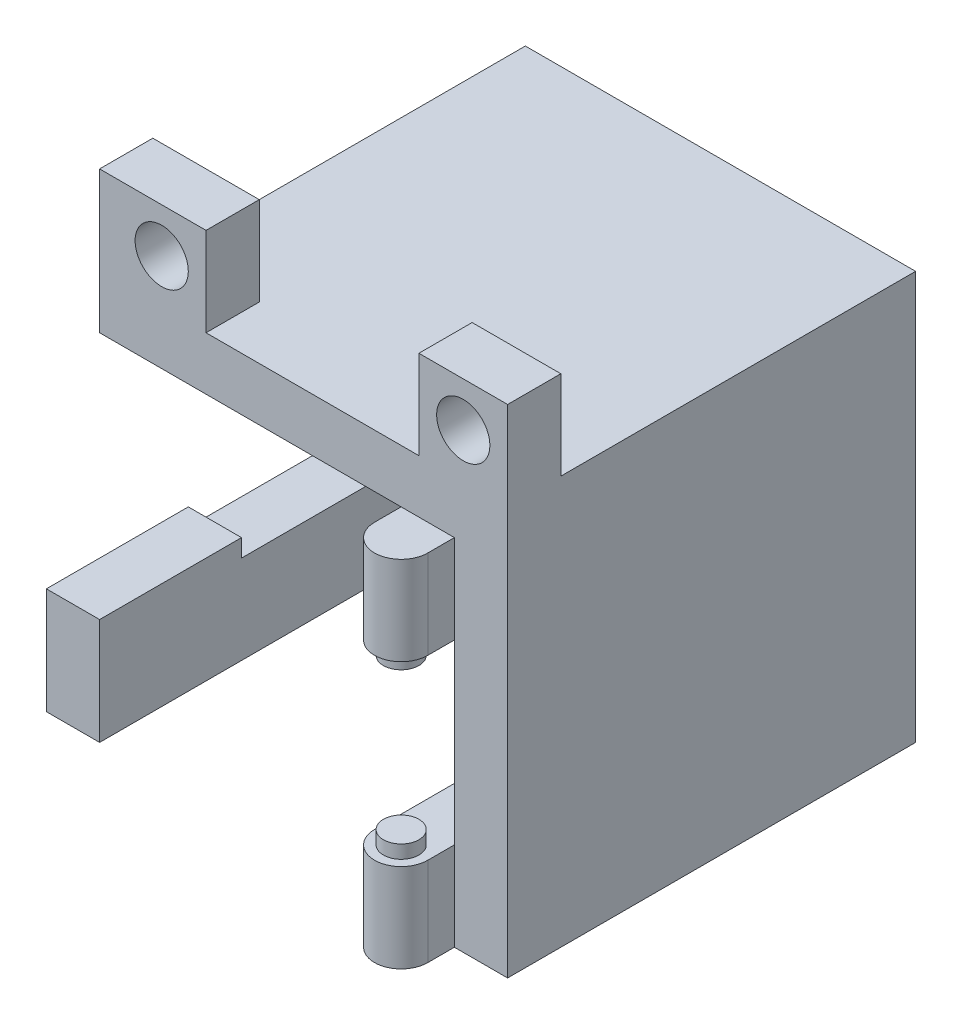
ISO-10303-21;
HEADER;
FILE_DESCRIPTION(('STEP AP214'),'2;1');
FILE_NAME('part.step','',(''),(''),'','','');
FILE_SCHEMA(('AUTOMOTIVE_DESIGN { 1 0 10303 214 1 1 1 1 }'));
ENDSEC;
DATA;
#1=APPLICATION_CONTEXT('core data for automotive mechanical design processes');
#2=APPLICATION_PROTOCOL_DEFINITION('international standard','automotive_design',2000,#1);
#3=PRODUCT_CONTEXT('',#1,'mechanical');
#4=PRODUCT('Part','Part','',(#3));
#5=PRODUCT_RELATED_PRODUCT_CATEGORY('part','',(#4));
#6=PRODUCT_DEFINITION_FORMATION('','',#4);
#7=PRODUCT_DEFINITION_CONTEXT('part definition',#1,'design');
#8=PRODUCT_DEFINITION('design','',#6,#7);
#9=PRODUCT_DEFINITION_SHAPE('','',#8);
#10=(LENGTH_UNIT() NAMED_UNIT(*) SI_UNIT(.MILLI.,.METRE.));
#11=(NAMED_UNIT(*) PLANE_ANGLE_UNIT() SI_UNIT($,.RADIAN.));
#12=(NAMED_UNIT(*) SI_UNIT($,.STERADIAN.) SOLID_ANGLE_UNIT());
#13=UNCERTAINTY_MEASURE_WITH_UNIT(LENGTH_MEASURE(1.E-05),#10,'distance_accuracy_value','');
#14=(GEOMETRIC_REPRESENTATION_CONTEXT(3) GLOBAL_UNCERTAINTY_ASSIGNED_CONTEXT((#13)) GLOBAL_UNIT_ASSIGNED_CONTEXT((#10,
#11,#12)) REPRESENTATION_CONTEXT('',''));
#15=CARTESIAN_POINT('',(0.,0.,0.));
#16=DIRECTION('',(0.,0.,1.));
#17=DIRECTION('',(1.,0.,0.));
#18=AXIS2_PLACEMENT_3D('',#15,#16,#17);
#19=CARTESIAN_POINT('',(-10.,20.,-8.5));
#20=DIRECTION('',(0.,1.,0.));
#21=DIRECTION('',(0.,0.,1.));
#22=AXIS2_PLACEMENT_3D('',#19,#20,#21);
#23=PLANE('',#22);
#24=DIRECTION('',(0.,0.,-1.));
#25=VECTOR('',#24,1.);
#26=CARTESIAN_POINT('',(7.,20.,11.5));
#27=LINE('',#26,#25);
#28=CARTESIAN_POINT('',(7.,20.,11.5));
#29=VERTEX_POINT('',#28);
#30=CARTESIAN_POINT('',(7.,20.,8.5));
#31=VERTEX_POINT('',#30);
#32=EDGE_CURVE('E65',#29,#31,#27,.T.);
#33=ORIENTED_EDGE('',*,*,#32,.F.);
#34=DIRECTION('',(-1.,0.,0.));
#35=VECTOR('',#34,1.);
#36=CARTESIAN_POINT('',(-10.,20.,11.5));
#37=LINE('',#36,#35);
#38=CARTESIAN_POINT('',(-10.,20.,11.5));
#39=VERTEX_POINT('',#38);
#40=EDGE_CURVE('E591',#29,#39,#37,.T.);
#41=ORIENTED_EDGE('',*,*,#40,.T.);
#42=DIRECTION('',(0.,0.,1.));
#43=VECTOR('',#42,1.);
#44=CARTESIAN_POINT('',(-10.,20.,11.5));
#45=LINE('',#44,#43);
#46=CARTESIAN_POINT('',(-10.,20.,3.5));
#47=VERTEX_POINT('',#46);
#48=EDGE_CURVE('E374',#47,#39,#45,.T.);
#49=ORIENTED_EDGE('',*,*,#48,.F.);
#50=DIRECTION('',(1.,0.,0.));
#51=VECTOR('',#50,1.);
#52=CARTESIAN_POINT('',(-10.,20.,3.5));
#53=LINE('',#52,#51);
#54=CARTESIAN_POINT('',(-9.,20.,3.5));
#55=VERTEX_POINT('',#54);
#56=EDGE_CURVE('E390',#47,#55,#53,.T.);
#57=ORIENTED_EDGE('',*,*,#56,.T.);
#58=DIRECTION('',(0.,0.,1.));
#59=VECTOR('',#58,1.);
#60=CARTESIAN_POINT('',(-9.,20.,-11.501));
#61=LINE('',#60,#59);
#62=CARTESIAN_POINT('',(-9.,20.,-11.5));
#63=VERTEX_POINT('',#62);
#64=EDGE_CURVE('E499',#63,#55,#61,.T.);
#65=ORIENTED_EDGE('',*,*,#64,.F.);
#66=DIRECTION('',(1.,0.,0.));
#67=VECTOR('',#66,1.);
#68=CARTESIAN_POINT('',(-9.,20.,-11.5));
#69=LINE('',#68,#67);
#70=CARTESIAN_POINT('',(-8.,20.,-11.5));
#71=VERTEX_POINT('',#70);
#72=EDGE_CURVE('E532',#63,#71,#69,.T.);
#73=ORIENTED_EDGE('',*,*,#72,.T.);
#74=DIRECTION('',(0.,0.,1.));
#75=VECTOR('',#74,1.);
#76=CARTESIAN_POINT('',(-8.,20.,-11.501));
#77=LINE('',#76,#75);
#78=CARTESIAN_POINT('',(-8.,20.,-8.5));
#79=VERTEX_POINT('',#78);
#80=EDGE_CURVE('E546',#71,#79,#77,.T.);
#81=ORIENTED_EDGE('',*,*,#80,.T.);
#82=DIRECTION('',(-1.,0.,0.));
#83=VECTOR('',#82,1.);
#84=CARTESIAN_POINT('',(-10.,20.,-8.5));
#85=LINE('',#84,#83);
#86=CARTESIAN_POINT('',(10.,20.,-8.5));
#87=VERTEX_POINT('',#86);
#88=EDGE_CURVE('E579',#87,#79,#85,.T.);
#89=ORIENTED_EDGE('',*,*,#88,.F.);
#90=DIRECTION('',(0.,0.,1.));
#91=VECTOR('',#90,1.);
#92=CARTESIAN_POINT('',(10.,20.,-8.5));
#93=LINE('',#92,#91);
#94=CARTESIAN_POINT('',(10.,20.,8.5));
#95=VERTEX_POINT('',#94);
#96=EDGE_CURVE('E596',#87,#95,#93,.T.);
#97=ORIENTED_EDGE('',*,*,#96,.T.);
#98=DIRECTION('',(1.,0.,0.));
#99=VECTOR('',#98,1.);
#100=CARTESIAN_POINT('',(10.,20.,8.5));
#101=LINE('',#100,#99);
#102=EDGE_CURVE('E61',#31,#95,#101,.T.);
#103=ORIENTED_EDGE('',*,*,#102,.F.);
#104=EDGE_LOOP('',(#33,#41,#49,#57,#65,#73,#81,#89,#97,#103));
#105=FACE_BOUND('',#104,.T.);
#106=ADVANCED_FACE('F45',(#105),#23,.F.);
#107=CARTESIAN_POINT('',(10.,20.,-8.5));
#108=DIRECTION('',(1.,0.,0.));
#109=DIRECTION('',(0.,1.,0.));
#110=AXIS2_PLACEMENT_3D('',#107,#108,#109);
#111=PLANE('',#110);
#112=DIRECTION('',(0.,1.,0.));
#113=VECTOR('',#112,1.);
#114=CARTESIAN_POINT('',(10.,15.,8.5));
#115=LINE('',#114,#113);
#116=CARTESIAN_POINT('',(10.,15.,8.5));
#117=VERTEX_POINT('',#116);
#118=EDGE_CURVE('E284',#117,#95,#115,.T.);
#119=ORIENTED_EDGE('',*,*,#118,.T.);
#120=ORIENTED_EDGE('',*,*,#96,.F.);
#121=DIRECTION('',(0.,1.,0.));
#122=VECTOR('',#121,1.);
#123=CARTESIAN_POINT('',(10.,20.,-8.5));
#124=LINE('',#123,#122);
#125=CARTESIAN_POINT('',(10.,0.,-8.5));
#126=VERTEX_POINT('',#125);
#127=EDGE_CURVE('E575',#126,#87,#124,.T.);
#128=ORIENTED_EDGE('',*,*,#127,.F.);
#129=DIRECTION('',(0.,0.,1.));
#130=VECTOR('',#129,1.);
#131=CARTESIAN_POINT('',(10.,0.,-8.5));
#132=LINE('',#131,#130);
#133=CARTESIAN_POINT('',(10.,0.,8.5));
#134=VERTEX_POINT('',#133);
#135=EDGE_CURVE('E600',#126,#134,#132,.T.);
#136=ORIENTED_EDGE('',*,*,#135,.T.);
#137=DIRECTION('',(0.,-1.,0.));
#138=VECTOR('',#137,1.);
#139=CARTESIAN_POINT('',(10.,5.,8.5));
#140=LINE('',#139,#138);
#141=CARTESIAN_POINT('',(10.,5.,8.5));
#142=VERTEX_POINT('',#141);
#143=EDGE_CURVE('E352',#142,#134,#140,.T.);
#144=ORIENTED_EDGE('',*,*,#143,.F.);
#145=DIRECTION('',(0.,0.,1.));
#146=VECTOR('',#145,1.);
#147=CARTESIAN_POINT('',(10.,5.,11.5));
#148=LINE('',#147,#146);
#149=CARTESIAN_POINT('',(10.,5.,11.5));
#150=VERTEX_POINT('',#149);
#151=EDGE_CURVE('E322',#142,#150,#148,.T.);
#152=ORIENTED_EDGE('',*,*,#151,.T.);
#153=DIRECTION('',(0.,1.,0.));
#154=VECTOR('',#153,1.);
#155=CARTESIAN_POINT('',(10.,20.,11.5));
#156=LINE('',#155,#154);
#157=CARTESIAN_POINT('',(10.,15.,11.5));
#158=VERTEX_POINT('',#157);
#159=EDGE_CURVE('E592',#150,#158,#156,.T.);
#160=ORIENTED_EDGE('',*,*,#159,.T.);
#161=DIRECTION('',(0.,0.,1.));
#162=VECTOR('',#161,1.);
#163=CARTESIAN_POINT('',(10.,15.,11.5));
#164=LINE('',#163,#162);
#165=EDGE_CURVE('E288',#117,#158,#164,.T.);
#166=ORIENTED_EDGE('',*,*,#165,.F.);
#167=EDGE_LOOP('',(#119,#120,#128,#136,#144,#152,#160,#166));
#168=FACE_BOUND('',#167,.T.);
#169=ADVANCED_FACE('F730',(#168),#111,.F.);
#170=CARTESIAN_POINT('',(-9.,23.,-11.501));
#171=DIRECTION('',(1.,0.,0.));
#172=DIRECTION('',(0.,0.,-1.));
#173=AXIS2_PLACEMENT_3D('',#170,#171,#172);
#174=PLANE('',#173);
#175=DIRECTION('',(0.,-1.,0.));
#176=VECTOR('',#175,1.);
#177=CARTESIAN_POINT('',(-9.,20.,3.5));
#178=LINE('',#177,#176);
#179=CARTESIAN_POINT('',(-9.,23.,3.5));
#180=VERTEX_POINT('',#179);
#181=EDGE_CURVE('E356',#180,#55,#178,.T.);
#182=ORIENTED_EDGE('',*,*,#181,.F.);
#183=DIRECTION('',(0.,0.,1.));
#184=VECTOR('',#183,1.);
#185=CARTESIAN_POINT('',(-9.,23.,-11.501));
#186=LINE('',#185,#184);
#187=CARTESIAN_POINT('',(-9.,23.,-11.5));
#188=VERTEX_POINT('',#187);
#189=EDGE_CURVE('E541',#188,#180,#186,.T.);
#190=ORIENTED_EDGE('',*,*,#189,.F.);
#191=DIRECTION('',(0.,-1.,0.));
#192=VECTOR('',#191,1.);
#193=CARTESIAN_POINT('',(-9.,23.,-11.5));
#194=LINE('',#193,#192);
#195=EDGE_CURVE('E536',#188,#63,#194,.T.);
#196=ORIENTED_EDGE('',*,*,#195,.T.);
#197=ORIENTED_EDGE('',*,*,#64,.T.);
#198=EDGE_LOOP('',(#182,#190,#196,#197));
#199=FACE_BOUND('',#198,.T.);
#200=ADVANCED_FACE('F683',(#199),#174,.F.);
#201=CARTESIAN_POINT('',(-13.,5.,-11.501));
#202=DIRECTION('',(0.,-1.,0.));
#203=DIRECTION('',(0.,0.,-1.));
#204=AXIS2_PLACEMENT_3D('',#201,#202,#203);
#205=PLANE('',#204);
#206=DIRECTION('',(-1.,0.,0.));
#207=VECTOR('',#206,1.);
#208=CARTESIAN_POINT('',(-13.,5.,3.5));
#209=LINE('',#208,#207);
#210=CARTESIAN_POINT('',(-10.,5.,3.5));
#211=VERTEX_POINT('',#210);
#212=CARTESIAN_POINT('',(-13.,5.,3.5));
#213=VERTEX_POINT('',#212);
#214=EDGE_CURVE('E401',#211,#213,#209,.T.);
#215=ORIENTED_EDGE('',*,*,#214,.F.);
#216=DIRECTION('',(0.,0.,-1.));
#217=VECTOR('',#216,1.);
#218=CARTESIAN_POINT('',(-10.,5.,-11.501));
#219=LINE('',#218,#217);
#220=CARTESIAN_POINT('',(-10.,5.,-8.5));
#221=VERTEX_POINT('',#220);
#222=EDGE_CURVE('E505',#211,#221,#219,.T.);
#223=ORIENTED_EDGE('',*,*,#222,.T.);
#224=DIRECTION('',(-1.,0.,0.));
#225=VECTOR('',#224,1.);
#226=CARTESIAN_POINT('',(-13.,5.,-8.5));
#227=LINE('',#226,#225);
#228=CARTESIAN_POINT('',(-8.99999999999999,5.,-8.5));
#229=VERTEX_POINT('',#228);
#230=EDGE_CURVE('E545',#229,#221,#227,.T.);
#231=ORIENTED_EDGE('',*,*,#230,.F.);
#232=DIRECTION('',(0.,0.,1.));
#233=VECTOR('',#232,1.);
#234=CARTESIAN_POINT('',(-8.99999999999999,5.,-11.501));
#235=LINE('',#234,#233);
#236=CARTESIAN_POINT('',(-8.99999999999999,5.,-11.5));
#237=VERTEX_POINT('',#236);
#238=EDGE_CURVE('E555',#237,#229,#235,.T.);
#239=ORIENTED_EDGE('',*,*,#238,.F.);
#240=DIRECTION('',(-1.,0.,0.));
#241=VECTOR('',#240,1.);
#242=CARTESIAN_POINT('',(-13.,5.,-11.5));
#243=LINE('',#242,#241);
#244=CARTESIAN_POINT('',(-13.,5.,-11.5));
#245=VERTEX_POINT('',#244);
#246=EDGE_CURVE('E563',#237,#245,#243,.T.);
#247=ORIENTED_EDGE('',*,*,#246,.T.);
#248=DIRECTION('',(0.,0.,1.));
#249=VECTOR('',#248,1.);
#250=CARTESIAN_POINT('',(-13.,5.,-11.501));
#251=LINE('',#250,#249);
#252=EDGE_CURVE('E540',#245,#213,#251,.T.);
#253=ORIENTED_EDGE('',*,*,#252,.T.);
#254=EDGE_LOOP('',(#215,#223,#231,#239,#247,#253));
#255=FACE_BOUND('',#254,.T.);
#256=ADVANCED_FACE('F667',(#255),#205,.F.);
#257=CARTESIAN_POINT('',(-13.,23.,11.5));
#258=DIRECTION('',(0.,0.,-1.));
#259=DIRECTION('',(-1.,0.,0.));
#260=AXIS2_PLACEMENT_3D('',#257,#258,#259);
#261=PLANE('',#260);
#262=CARTESIAN_POINT('',(-6.5,25.5,11.5));
#263=DIRECTION('',(0.,0.,1.));
#264=DIRECTION('',(1.,0.,0.));
#265=AXIS2_PLACEMENT_3D('',#262,#263,#264);
#266=CIRCLE('',#265,1.5);
#267=CARTESIAN_POINT('',(-5.,25.5,11.5));
#268=VERTEX_POINT('',#267);
#269=EDGE_CURVE('E433',#268,#268,#266,.T.);
#270=ORIENTED_EDGE('',*,*,#269,.F.);
#271=EDGE_LOOP('',(#270));
#272=FACE_BOUND('',#271,.T.);
#273=CARTESIAN_POINT('',(10.5,25.5,11.5));
#274=DIRECTION('',(0.,0.,1.));
#275=DIRECTION('',(1.,0.,0.));
#276=AXIS2_PLACEMENT_3D('',#273,#274,#275);
#277=CIRCLE('',#276,1.5);
#278=CARTESIAN_POINT('',(12.,25.5,11.5));
#279=VERTEX_POINT('',#278);
#280=EDGE_CURVE('E437',#279,#279,#277,.T.);
#281=ORIENTED_EDGE('',*,*,#280,.F.);
#282=EDGE_LOOP('',(#281));
#283=FACE_BOUND('',#282,.T.);
#284=DIRECTION('',(1.,0.,0.));
#285=VECTOR('',#284,1.);
#286=CARTESIAN_POINT('',(-13.,23.,11.5));
#287=LINE('',#286,#285);
#288=CARTESIAN_POINT('',(-4.,23.,11.5));
#289=VERTEX_POINT('',#288);
#290=CARTESIAN_POINT('',(7.99999999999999,23.,11.5));
#291=VERTEX_POINT('',#290);
#292=EDGE_CURVE('E614',#289,#291,#287,.T.);
#293=ORIENTED_EDGE('',*,*,#292,.F.);
#294=DIRECTION('',(0.,1.,0.));
#295=VECTOR('',#294,1.);
#296=CARTESIAN_POINT('',(-3.99999999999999,23.,11.5));
#297=LINE('',#296,#295);
#298=CARTESIAN_POINT('',(-4.,28.,11.5));
#299=VERTEX_POINT('',#298);
#300=EDGE_CURVE('E464',#289,#299,#297,.T.);
#301=ORIENTED_EDGE('',*,*,#300,.T.);
#302=DIRECTION('',(-1.,0.,0.));
#303=VECTOR('',#302,1.);
#304=CARTESIAN_POINT('',(-9.,28.,11.5));
#305=LINE('',#304,#303);
#306=CARTESIAN_POINT('',(-10.,28.,11.5));
#307=VERTEX_POINT('',#306);
#308=EDGE_CURVE('E483',#299,#307,#305,.T.);
#309=ORIENTED_EDGE('',*,*,#308,.T.);
#310=DIRECTION('',(0.,1.,0.));
#311=VECTOR('',#310,1.);
#312=CARTESIAN_POINT('',(-10.,28.,11.5));
#313=LINE('',#312,#311);
#314=EDGE_CURVE('E378',#39,#307,#313,.T.);
#315=ORIENTED_EDGE('',*,*,#314,.F.);
#316=ORIENTED_EDGE('',*,*,#40,.F.);
#317=CARTESIAN_POINT('',(10.,20.,11.5));
#318=VERTEX_POINT('',#317);
#319=EDGE_CURVE('E571',#318,#29,#37,.T.);
#320=ORIENTED_EDGE('',*,*,#319,.F.);
#321=EDGE_CURVE('E586',#158,#318,#156,.T.);
#322=ORIENTED_EDGE('',*,*,#321,.F.);
#323=ORIENTED_EDGE('',*,*,#159,.F.);
#324=CARTESIAN_POINT('',(10.,0.,11.5));
#325=VERTEX_POINT('',#324);
#326=EDGE_CURVE('E587',#325,#150,#156,.T.);
#327=ORIENTED_EDGE('',*,*,#326,.F.);
#328=DIRECTION('',(1.,0.,0.));
#329=VECTOR('',#328,1.);
#330=CARTESIAN_POINT('',(-13.,0.,11.5));
#331=LINE('',#330,#329);
#332=CARTESIAN_POINT('',(13.,0.,11.5));
#333=VERTEX_POINT('',#332);
#334=EDGE_CURVE('E629',#325,#333,#331,.T.);
#335=ORIENTED_EDGE('',*,*,#334,.T.);
#336=DIRECTION('',(0.,-1.,0.));
#337=VECTOR('',#336,1.);
#338=CARTESIAN_POINT('',(13.,23.,11.5));
#339=LINE('',#338,#337);
#340=CARTESIAN_POINT('',(13.,28.,11.5));
#341=VERTEX_POINT('',#340);
#342=EDGE_CURVE('E617',#341,#333,#339,.T.);
#343=ORIENTED_EDGE('',*,*,#342,.F.);
#344=DIRECTION('',(-1.,0.,0.));
#345=VECTOR('',#344,1.);
#346=CARTESIAN_POINT('',(13.,28.,11.5));
#347=LINE('',#346,#345);
#348=CARTESIAN_POINT('',(8.,28.,11.5));
#349=VERTEX_POINT('',#348);
#350=EDGE_CURVE('E459',#341,#349,#347,.T.);
#351=ORIENTED_EDGE('',*,*,#350,.T.);
#352=DIRECTION('',(0.,-1.,0.));
#353=VECTOR('',#352,1.);
#354=CARTESIAN_POINT('',(8.,23.,11.5));
#355=LINE('',#354,#353);
#356=EDGE_CURVE('E455',#349,#291,#355,.T.);
#357=ORIENTED_EDGE('',*,*,#356,.T.);
#358=EDGE_LOOP('',(#293,#301,#309,#315,#316,#320,#322,#323,#327,#335,#343,#351,#357));
#359=FACE_BOUND('',#358,.T.);
#360=ADVANCED_FACE('F699',(#272,#283,#359),#261,.F.);
#361=CARTESIAN_POINT('',(13.,23.,11.5));
#362=DIRECTION('',(-1.,0.,0.));
#363=DIRECTION('',(0.,0.,1.));
#364=AXIS2_PLACEMENT_3D('',#361,#362,#363);
#365=PLANE('',#364);
#366=DIRECTION('',(0.,0.,-1.));
#367=VECTOR('',#366,1.);
#368=CARTESIAN_POINT('',(13.,0.,11.5));
#369=LINE('',#368,#367);
#370=CARTESIAN_POINT('',(13.,0.,-11.5));
#371=VERTEX_POINT('',#370);
#372=EDGE_CURVE('E599',#333,#371,#369,.T.);
#373=ORIENTED_EDGE('',*,*,#372,.T.);
#374=DIRECTION('',(0.,-1.,0.));
#375=VECTOR('',#374,1.);
#376=CARTESIAN_POINT('',(13.,23.,-11.5));
#377=LINE('',#376,#375);
#378=CARTESIAN_POINT('',(13.,23.,-11.5));
#379=VERTEX_POINT('',#378);
#380=EDGE_CURVE('E54',#379,#371,#377,.T.);
#381=ORIENTED_EDGE('',*,*,#380,.F.);
#382=DIRECTION('',(0.,0.,-1.));
#383=VECTOR('',#382,1.);
#384=CARTESIAN_POINT('',(13.,23.,11.5));
#385=LINE('',#384,#383);
#386=CARTESIAN_POINT('',(13.,23.,8.5));
#387=VERTEX_POINT('',#386);
#388=EDGE_CURVE('E606',#387,#379,#385,.T.);
#389=ORIENTED_EDGE('',*,*,#388,.F.);
#390=DIRECTION('',(0.,1.,0.));
#391=VECTOR('',#390,1.);
#392=CARTESIAN_POINT('',(13.,23.,8.5));
#393=LINE('',#392,#391);
#394=CARTESIAN_POINT('',(13.,28.,8.5));
#395=VERTEX_POINT('',#394);
#396=EDGE_CURVE('E460',#387,#395,#393,.T.);
#397=ORIENTED_EDGE('',*,*,#396,.T.);
#398=DIRECTION('',(0.,0.,1.));
#399=VECTOR('',#398,1.);
#400=CARTESIAN_POINT('',(13.,28.,8.5));
#401=LINE('',#400,#399);
#402=EDGE_CURVE('E444',#395,#341,#401,.T.);
#403=ORIENTED_EDGE('',*,*,#402,.T.);
#404=ORIENTED_EDGE('',*,*,#342,.T.);
#405=EDGE_LOOP('',(#373,#381,#389,#397,#403,#404));
#406=FACE_BOUND('',#405,.T.);
#407=ADVANCED_FACE('F47',(#406),#365,.F.);
#408=CARTESIAN_POINT('',(-13.,23.,-11.5));
#409=DIRECTION('',(0.,0.,1.));
#410=DIRECTION('',(1.,0.,0.));
#411=AXIS2_PLACEMENT_3D('',#408,#409,#410);
#412=PLANE('',#411);
#413=ORIENTED_EDGE('',*,*,#72,.F.);
#414=ORIENTED_EDGE('',*,*,#195,.F.);
#415=DIRECTION('',(-1.,0.,0.));
#416=VECTOR('',#415,1.);
#417=CARTESIAN_POINT('',(-13.,23.,-11.5));
#418=LINE('',#417,#416);
#419=EDGE_CURVE('E609',#379,#188,#418,.T.);
#420=ORIENTED_EDGE('',*,*,#419,.F.);
#421=ORIENTED_EDGE('',*,*,#380,.T.);
#422=DIRECTION('',(-1.,0.,0.));
#423=VECTOR('',#422,1.);
#424=CARTESIAN_POINT('',(-13.,0.,-11.5));
#425=LINE('',#424,#423);
#426=CARTESIAN_POINT('',(-13.,0.,-11.5));
#427=VERTEX_POINT('',#426);
#428=EDGE_CURVE('E621',#371,#427,#425,.T.);
#429=ORIENTED_EDGE('',*,*,#428,.T.);
#430=DIRECTION('',(0.,-1.,0.));
#431=VECTOR('',#430,1.);
#432=CARTESIAN_POINT('',(-13.,23.,-11.5));
#433=LINE('',#432,#431);
#434=EDGE_CURVE('E639',#245,#427,#433,.T.);
#435=ORIENTED_EDGE('',*,*,#434,.F.);
#436=ORIENTED_EDGE('',*,*,#246,.F.);
#437=DIRECTION('',(0.,-1.,0.));
#438=VECTOR('',#437,1.);
#439=CARTESIAN_POINT('',(-9.,11.,-11.5));
#440=LINE('',#439,#438);
#441=CARTESIAN_POINT('',(-9.,11.,-11.5));
#442=VERTEX_POINT('',#441);
#443=EDGE_CURVE('E520',#442,#237,#440,.T.);
#444=ORIENTED_EDGE('',*,*,#443,.F.);
#445=DIRECTION('',(-1.,0.,0.));
#446=VECTOR('',#445,1.);
#447=CARTESIAN_POINT('',(-9.,11.,-11.5));
#448=LINE('',#447,#446);
#449=CARTESIAN_POINT('',(-7.99999999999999,11.,-11.5));
#450=VERTEX_POINT('',#449);
#451=EDGE_CURVE('E524',#450,#442,#448,.T.);
#452=ORIENTED_EDGE('',*,*,#451,.F.);
#453=DIRECTION('',(0.,-1.,0.));
#454=VECTOR('',#453,1.);
#455=CARTESIAN_POINT('',(-8.,20.,-11.5));
#456=LINE('',#455,#454);
#457=EDGE_CURVE('E528',#71,#450,#456,.T.);
#458=ORIENTED_EDGE('',*,*,#457,.F.);
#459=EDGE_LOOP('',(#413,#414,#420,#421,#429,#435,#436,#444,#452,#458));
#460=FACE_BOUND('',#459,.T.);
#461=ADVANCED_FACE('F647',(#460),#412,.F.);
#462=CARTESIAN_POINT('',(-13.,23.,11.5));
#463=DIRECTION('',(1.,0.,0.));
#464=DIRECTION('',(0.,0.,-1.));
#465=AXIS2_PLACEMENT_3D('',#462,#463,#464);
#466=PLANE('',#465);
#467=DIRECTION('',(0.,-1.,0.));
#468=VECTOR('',#467,1.);
#469=CARTESIAN_POINT('',(-13.,23.,11.5));
#470=LINE('',#469,#468);
#471=CARTESIAN_POINT('',(-13.,6.,11.5));
#472=VERTEX_POINT('',#471);
#473=CARTESIAN_POINT('',(-13.,0.,11.5));
#474=VERTEX_POINT('',#473);
#475=EDGE_CURVE('E636',#472,#474,#470,.T.);
#476=ORIENTED_EDGE('',*,*,#475,.F.);
#477=DIRECTION('',(0.,0.,1.));
#478=VECTOR('',#477,1.);
#479=CARTESIAN_POINT('',(-13.,6.,11.5));
#480=LINE('',#479,#478);
#481=CARTESIAN_POINT('',(-13.,6.,3.5));
#482=VERTEX_POINT('',#481);
#483=EDGE_CURVE('E402',#482,#472,#480,.T.);
#484=ORIENTED_EDGE('',*,*,#483,.F.);
#485=DIRECTION('',(0.,-1.,0.));
#486=VECTOR('',#485,1.);
#487=CARTESIAN_POINT('',(-13.,6.,3.5));
#488=LINE('',#487,#486);
#489=EDGE_CURVE('E416',#482,#213,#488,.T.);
#490=ORIENTED_EDGE('',*,*,#489,.T.);
#491=ORIENTED_EDGE('',*,*,#252,.F.);
#492=ORIENTED_EDGE('',*,*,#434,.T.);
#493=DIRECTION('',(0.,0.,1.));
#494=VECTOR('',#493,1.);
#495=CARTESIAN_POINT('',(-13.,0.,11.5));
#496=LINE('',#495,#494);
#497=EDGE_CURVE('E625',#427,#474,#496,.T.);
#498=ORIENTED_EDGE('',*,*,#497,.T.);
#499=EDGE_LOOP('',(#476,#484,#490,#491,#492,#498));
#500=FACE_BOUND('',#499,.T.);
#501=ADVANCED_FACE('F659',(#500),#466,.F.);
#502=DIRECTION('',(0.,-1.,0.));
#503=VECTOR('',#502,1.);
#504=CARTESIAN_POINT('',(-10.,20.,11.5));
#505=LINE('',#504,#503);
#506=CARTESIAN_POINT('',(-10.,6.,11.5));
#507=VERTEX_POINT('',#506);
#508=CARTESIAN_POINT('',(-10.,0.,11.5));
#509=VERTEX_POINT('',#508);
#510=EDGE_CURVE('E566',#507,#509,#505,.T.);
#511=ORIENTED_EDGE('',*,*,#510,.F.);
#512=DIRECTION('',(1.,0.,0.));
#513=VECTOR('',#512,1.);
#514=CARTESIAN_POINT('',(-13.,6.,11.5));
#515=LINE('',#514,#513);
#516=EDGE_CURVE('E406',#472,#507,#515,.T.);
#517=ORIENTED_EDGE('',*,*,#516,.F.);
#518=ORIENTED_EDGE('',*,*,#475,.T.);
#519=EDGE_CURVE('E610',#474,#509,#331,.T.);
#520=ORIENTED_EDGE('',*,*,#519,.T.);
#521=EDGE_LOOP('',(#511,#517,#518,#520));
#522=FACE_BOUND('',#521,.T.);
#523=ADVANCED_FACE('F740',(#522),#261,.F.);
#524=CARTESIAN_POINT('',(0.,23.,0.));
#525=DIRECTION('',(0.,-1.,0.));
#526=DIRECTION('',(0.,0.,-1.));
#527=AXIS2_PLACEMENT_3D('',#524,#525,#526);
#528=PLANE('',#527);
#529=ORIENTED_EDGE('',*,*,#292,.T.);
#530=DIRECTION('',(0.,0.,1.));
#531=VECTOR('',#530,1.);
#532=CARTESIAN_POINT('',(8.,23.,8.5));
#533=LINE('',#532,#531);
#534=CARTESIAN_POINT('',(8.,23.,8.5));
#535=VERTEX_POINT('',#534);
#536=EDGE_CURVE('E432',#535,#291,#533,.T.);
#537=ORIENTED_EDGE('',*,*,#536,.F.);
#538=DIRECTION('',(1.,0.,0.));
#539=VECTOR('',#538,1.);
#540=CARTESIAN_POINT('',(13.,23.,8.5));
#541=LINE('',#540,#539);
#542=EDGE_CURVE('E448',#535,#387,#541,.T.);
#543=ORIENTED_EDGE('',*,*,#542,.T.);
#544=ORIENTED_EDGE('',*,*,#388,.T.);
#545=ORIENTED_EDGE('',*,*,#419,.T.);
#546=ORIENTED_EDGE('',*,*,#189,.T.);
#547=DIRECTION('',(1.,0.,0.));
#548=VECTOR('',#547,1.);
#549=CARTESIAN_POINT('',(-10.,23.,3.5));
#550=LINE('',#549,#548);
#551=CARTESIAN_POINT('',(-10.,23.,3.5));
#552=VERTEX_POINT('',#551);
#553=EDGE_CURVE('E397',#552,#180,#550,.T.);
#554=ORIENTED_EDGE('',*,*,#553,.F.);
#555=DIRECTION('',(0.,0.,-1.));
#556=VECTOR('',#555,1.);
#557=CARTESIAN_POINT('',(-10.,23.,3.5));
#558=LINE('',#557,#556);
#559=CARTESIAN_POINT('',(-10.,23.,8.5));
#560=VERTEX_POINT('',#559);
#561=EDGE_CURVE('E367',#560,#552,#558,.T.);
#562=ORIENTED_EDGE('',*,*,#561,.F.);
#563=DIRECTION('',(1.,0.,0.));
#564=VECTOR('',#563,1.);
#565=CARTESIAN_POINT('',(-9.,23.,8.5));
#566=LINE('',#565,#564);
#567=CARTESIAN_POINT('',(-3.99999999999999,23.,8.5));
#568=VERTEX_POINT('',#567);
#569=EDGE_CURVE('E478',#560,#568,#566,.T.);
#570=ORIENTED_EDGE('',*,*,#569,.T.);
#571=DIRECTION('',(0.,0.,1.));
#572=VECTOR('',#571,1.);
#573=CARTESIAN_POINT('',(-3.99999999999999,23.,8.5));
#574=LINE('',#573,#572);
#575=EDGE_CURVE('E490',#568,#289,#574,.T.);
#576=ORIENTED_EDGE('',*,*,#575,.T.);
#577=EDGE_LOOP('',(#529,#537,#543,#544,#545,#546,#554,#562,#570,#576));
#578=FACE_BOUND('',#577,.T.);
#579=ADVANCED_FACE('F685',(#578),#528,.F.);
#580=CARTESIAN_POINT('',(0.,0.,0.));
#581=DIRECTION('',(0.,-1.,0.));
#582=DIRECTION('',(0.,0.,-1.));
#583=AXIS2_PLACEMENT_3D('',#580,#581,#582);
#584=PLANE('',#583);
#585=DIRECTION('',(0.,0.,1.));
#586=VECTOR('',#585,1.);
#587=CARTESIAN_POINT('',(-10.,0.,-8.5));
#588=LINE('',#587,#586);
#589=CARTESIAN_POINT('',(-10.,0.,-8.5));
#590=VERTEX_POINT('',#589);
#591=EDGE_CURVE('E583',#590,#509,#588,.T.);
#592=ORIENTED_EDGE('',*,*,#591,.T.);
#593=ORIENTED_EDGE('',*,*,#519,.F.);
#594=ORIENTED_EDGE('',*,*,#497,.F.);
#595=ORIENTED_EDGE('',*,*,#428,.F.);
#596=ORIENTED_EDGE('',*,*,#372,.F.);
#597=ORIENTED_EDGE('',*,*,#334,.F.);
#598=DIRECTION('',(0.,0.,1.));
#599=VECTOR('',#598,1.);
#600=CARTESIAN_POINT('',(10.,0.,11.5));
#601=LINE('',#600,#599);
#602=CARTESIAN_POINT('',(10.,0.,13.));
#603=VERTEX_POINT('',#602);
#604=EDGE_CURVE('E349',#325,#603,#601,.T.);
#605=ORIENTED_EDGE('',*,*,#604,.T.);
#606=CARTESIAN_POINT('',(8.5,0.,13.));
#607=DIRECTION('',(0.,-1.,0.));
#608=DIRECTION('',(0.,0.,-1.));
#609=AXIS2_PLACEMENT_3D('',#606,#607,#608);
#610=CIRCLE('',#609,1.5);
#611=CARTESIAN_POINT('',(7.,0.,13.));
#612=VERTEX_POINT('',#611);
#613=EDGE_CURVE('E321',#603,#612,#610,.T.);
#614=ORIENTED_EDGE('',*,*,#613,.T.);
#615=DIRECTION('',(0.,0.,-1.));
#616=VECTOR('',#615,1.);
#617=CARTESIAN_POINT('',(7.,0.,8.5));
#618=LINE('',#617,#616);
#619=CARTESIAN_POINT('',(7.,0.,8.5));
#620=VERTEX_POINT('',#619);
#621=EDGE_CURVE('E341',#612,#620,#618,.T.);
#622=ORIENTED_EDGE('',*,*,#621,.T.);
#623=DIRECTION('',(1.,0.,0.));
#624=VECTOR('',#623,1.);
#625=CARTESIAN_POINT('',(10.,0.,8.5));
#626=LINE('',#625,#624);
#627=EDGE_CURVE('E345',#620,#134,#626,.T.);
#628=ORIENTED_EDGE('',*,*,#627,.T.);
#629=ORIENTED_EDGE('',*,*,#135,.F.);
#630=DIRECTION('',(1.,0.,0.));
#631=VECTOR('',#630,1.);
#632=CARTESIAN_POINT('',(-10.,0.,-8.5));
#633=LINE('',#632,#631);
#634=EDGE_CURVE('E570',#590,#126,#633,.T.);
#635=ORIENTED_EDGE('',*,*,#634,.F.);
#636=EDGE_LOOP('',(#592,#593,#594,#595,#596,#597,#605,#614,#622,#628,#629,#635));
#637=FACE_BOUND('',#636,.T.);
#638=ADVANCED_FACE('F655',(#637),#584,.T.);
#639=CARTESIAN_POINT('',(-10.,20.,-8.5));
#640=DIRECTION('',(-1.,0.,0.));
#641=DIRECTION('',(0.,0.,1.));
#642=AXIS2_PLACEMENT_3D('',#639,#640,#641);
#643=PLANE('',#642);
#644=DIRECTION('',(0.,-1.,0.));
#645=VECTOR('',#644,1.);
#646=CARTESIAN_POINT('',(-10.,20.,-8.5));
#647=LINE('',#646,#645);
#648=EDGE_CURVE('E567',#221,#590,#647,.T.);
#649=ORIENTED_EDGE('',*,*,#648,.F.);
#650=ORIENTED_EDGE('',*,*,#222,.F.);
#651=DIRECTION('',(0.,-1.,0.));
#652=VECTOR('',#651,1.);
#653=CARTESIAN_POINT('',(-10.,6.,3.5));
#654=LINE('',#653,#652);
#655=CARTESIAN_POINT('',(-10.,6.,3.5));
#656=VERTEX_POINT('',#655);
#657=EDGE_CURVE('E423',#656,#211,#654,.T.);
#658=ORIENTED_EDGE('',*,*,#657,.F.);
#659=DIRECTION('',(0.,0.,-1.));
#660=VECTOR('',#659,1.);
#661=CARTESIAN_POINT('',(-10.,6.,11.5));
#662=LINE('',#661,#660);
#663=EDGE_CURVE('E410',#507,#656,#662,.T.);
#664=ORIENTED_EDGE('',*,*,#663,.F.);
#665=ORIENTED_EDGE('',*,*,#510,.T.);
#666=ORIENTED_EDGE('',*,*,#591,.F.);
#667=EDGE_LOOP('',(#649,#650,#658,#664,#665,#666));
#668=FACE_BOUND('',#667,.T.);
#669=ADVANCED_FACE('F737',(#668),#643,.F.);
#670=CARTESIAN_POINT('',(0.,0.,-8.5));
#671=DIRECTION('',(0.,0.,1.));
#672=DIRECTION('',(1.,0.,0.));
#673=AXIS2_PLACEMENT_3D('',#670,#671,#672);
#674=PLANE('',#673);
#675=DIRECTION('',(0.,-1.,0.));
#676=VECTOR('',#675,1.);
#677=CARTESIAN_POINT('',(-8.,20.,-8.5));
#678=LINE('',#677,#676);
#679=CARTESIAN_POINT('',(-7.99999999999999,11.,-8.5));
#680=VERTEX_POINT('',#679);
#681=EDGE_CURVE('E516',#79,#680,#678,.T.);
#682=ORIENTED_EDGE('',*,*,#681,.T.);
#683=DIRECTION('',(-1.,0.,0.));
#684=VECTOR('',#683,1.);
#685=CARTESIAN_POINT('',(-9.,11.,-8.5));
#686=LINE('',#685,#684);
#687=CARTESIAN_POINT('',(-9.,11.,-8.5));
#688=VERTEX_POINT('',#687);
#689=EDGE_CURVE('E512',#680,#688,#686,.T.);
#690=ORIENTED_EDGE('',*,*,#689,.T.);
#691=DIRECTION('',(0.,-1.,0.));
#692=VECTOR('',#691,1.);
#693=CARTESIAN_POINT('',(-9.,11.,-8.5));
#694=LINE('',#693,#692);
#695=EDGE_CURVE('E508',#688,#229,#694,.T.);
#696=ORIENTED_EDGE('',*,*,#695,.T.);
#697=ORIENTED_EDGE('',*,*,#230,.T.);
#698=ORIENTED_EDGE('',*,*,#648,.T.);
#699=ORIENTED_EDGE('',*,*,#634,.T.);
#700=ORIENTED_EDGE('',*,*,#127,.T.);
#701=ORIENTED_EDGE('',*,*,#88,.T.);
#702=EDGE_LOOP('',(#682,#690,#696,#697,#698,#699,#700,#701));
#703=FACE_BOUND('',#702,.T.);
#704=ADVANCED_FACE('F732',(#703),#674,.T.);
#705=CARTESIAN_POINT('',(-8.,20.,-11.501));
#706=DIRECTION('',(1.,0.,0.));
#707=DIRECTION('',(0.,1.,0.));
#708=AXIS2_PLACEMENT_3D('',#705,#706,#707);
#709=PLANE('',#708);
#710=ORIENTED_EDGE('',*,*,#457,.T.);
#711=DIRECTION('',(0.,0.,1.));
#712=VECTOR('',#711,1.);
#713=CARTESIAN_POINT('',(-7.99999999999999,11.,-11.501));
#714=LINE('',#713,#712);
#715=EDGE_CURVE('E549',#450,#680,#714,.T.);
#716=ORIENTED_EDGE('',*,*,#715,.T.);
#717=ORIENTED_EDGE('',*,*,#681,.F.);
#718=ORIENTED_EDGE('',*,*,#80,.F.);
#719=EDGE_LOOP('',(#710,#716,#717,#718));
#720=FACE_BOUND('',#719,.T.);
#721=ADVANCED_FACE('F677',(#720),#709,.F.);
#722=CARTESIAN_POINT('',(-9.,11.,-11.501));
#723=DIRECTION('',(0.,-1.,0.));
#724=DIRECTION('',(0.,0.,-1.));
#725=AXIS2_PLACEMENT_3D('',#722,#723,#724);
#726=PLANE('',#725);
#727=ORIENTED_EDGE('',*,*,#451,.T.);
#728=DIRECTION('',(0.,0.,1.));
#729=VECTOR('',#728,1.);
#730=CARTESIAN_POINT('',(-9.,11.,-11.501));
#731=LINE('',#730,#729);
#732=EDGE_CURVE('E552',#442,#688,#731,.T.);
#733=ORIENTED_EDGE('',*,*,#732,.T.);
#734=ORIENTED_EDGE('',*,*,#689,.F.);
#735=ORIENTED_EDGE('',*,*,#715,.F.);
#736=EDGE_LOOP('',(#727,#733,#734,#735));
#737=FACE_BOUND('',#736,.T.);
#738=ADVANCED_FACE('F674',(#737),#726,.F.);
#739=CARTESIAN_POINT('',(-9.,11.,-11.501));
#740=DIRECTION('',(1.,0.,0.));
#741=DIRECTION('',(0.,1.,0.));
#742=AXIS2_PLACEMENT_3D('',#739,#740,#741);
#743=PLANE('',#742);
#744=ORIENTED_EDGE('',*,*,#443,.T.);
#745=ORIENTED_EDGE('',*,*,#238,.T.);
#746=ORIENTED_EDGE('',*,*,#695,.F.);
#747=ORIENTED_EDGE('',*,*,#732,.F.);
#748=EDGE_LOOP('',(#744,#745,#746,#747));
#749=FACE_BOUND('',#748,.T.);
#750=ADVANCED_FACE('F671',(#749),#743,.F.);
#751=CARTESIAN_POINT('',(-9.,28.,8.5));
#752=DIRECTION('',(0.,1.,0.));
#753=DIRECTION('',(0.,0.,1.));
#754=AXIS2_PLACEMENT_3D('',#751,#752,#753);
#755=PLANE('',#754);
#756=ORIENTED_EDGE('',*,*,#308,.F.);
#757=DIRECTION('',(0.,0.,1.));
#758=VECTOR('',#757,1.);
#759=CARTESIAN_POINT('',(-4.,28.,8.5));
#760=LINE('',#759,#758);
#761=CARTESIAN_POINT('',(-4.,28.,8.5));
#762=VERTEX_POINT('',#761);
#763=EDGE_CURVE('E496',#762,#299,#760,.T.);
#764=ORIENTED_EDGE('',*,*,#763,.F.);
#765=DIRECTION('',(-1.,0.,0.));
#766=VECTOR('',#765,1.);
#767=CARTESIAN_POINT('',(-9.,28.,8.5));
#768=LINE('',#767,#766);
#769=CARTESIAN_POINT('',(-10.,28.,8.5));
#770=VERTEX_POINT('',#769);
#771=EDGE_CURVE('E487',#762,#770,#768,.T.);
#772=ORIENTED_EDGE('',*,*,#771,.T.);
#773=DIRECTION('',(0.,0.,-1.));
#774=VECTOR('',#773,1.);
#775=CARTESIAN_POINT('',(-10.,28.,8.5));
#776=LINE('',#775,#774);
#777=EDGE_CURVE('E382',#307,#770,#776,.T.);
#778=ORIENTED_EDGE('',*,*,#777,.F.);
#779=EDGE_LOOP('',(#756,#764,#772,#778));
#780=FACE_BOUND('',#779,.T.);
#781=ADVANCED_FACE('F819',(#780),#755,.T.);
#782=CARTESIAN_POINT('',(-3.99999999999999,23.,8.5));
#783=DIRECTION('',(1.,0.,0.));
#784=DIRECTION('',(0.,1.,0.));
#785=AXIS2_PLACEMENT_3D('',#782,#783,#784);
#786=PLANE('',#785);
#787=ORIENTED_EDGE('',*,*,#300,.F.);
#788=ORIENTED_EDGE('',*,*,#575,.F.);
#789=DIRECTION('',(0.,1.,0.));
#790=VECTOR('',#789,1.);
#791=CARTESIAN_POINT('',(-3.99999999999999,23.,8.5));
#792=LINE('',#791,#790);
#793=EDGE_CURVE('E482',#568,#762,#792,.T.);
#794=ORIENTED_EDGE('',*,*,#793,.T.);
#795=ORIENTED_EDGE('',*,*,#763,.T.);
#796=EDGE_LOOP('',(#787,#788,#794,#795));
#797=FACE_BOUND('',#796,.T.);
#798=ADVANCED_FACE('F817',(#797),#786,.T.);
#799=CARTESIAN_POINT('',(0.,0.,8.5));
#800=DIRECTION('',(0.,0.,-1.));
#801=DIRECTION('',(-1.,0.,0.));
#802=AXIS2_PLACEMENT_3D('',#799,#800,#801);
#803=PLANE('',#802);
#804=CARTESIAN_POINT('',(-6.5,25.5,8.5));
#805=DIRECTION('',(0.,0.,1.));
#806=DIRECTION('',(1.,0.,0.));
#807=AXIS2_PLACEMENT_3D('',#804,#805,#806);
#808=CIRCLE('',#807,1.5);
#809=CARTESIAN_POINT('',(-5.,25.5,8.5));
#810=VERTEX_POINT('',#809);
#811=EDGE_CURVE('E428',#810,#810,#808,.T.);
#812=ORIENTED_EDGE('',*,*,#811,.T.);
#813=EDGE_LOOP('',(#812));
#814=FACE_BOUND('',#813,.T.);
#815=ORIENTED_EDGE('',*,*,#569,.F.);
#816=DIRECTION('',(0.,-1.,0.));
#817=VECTOR('',#816,1.);
#818=CARTESIAN_POINT('',(-10.,23.,8.5));
#819=LINE('',#818,#817);
#820=EDGE_CURVE('E386',#770,#560,#819,.T.);
#821=ORIENTED_EDGE('',*,*,#820,.F.);
#822=ORIENTED_EDGE('',*,*,#771,.F.);
#823=ORIENTED_EDGE('',*,*,#793,.F.);
#824=EDGE_LOOP('',(#815,#821,#822,#823));
#825=FACE_BOUND('',#824,.T.);
#826=ADVANCED_FACE('F812',(#814,#825),#803,.T.);
#827=CARTESIAN_POINT('',(8.,23.,8.5));
#828=DIRECTION('',(-1.,0.,0.));
#829=DIRECTION('',(0.,0.,1.));
#830=AXIS2_PLACEMENT_3D('',#827,#828,#829);
#831=PLANE('',#830);
#832=ORIENTED_EDGE('',*,*,#356,.F.);
#833=DIRECTION('',(0.,0.,1.));
#834=VECTOR('',#833,1.);
#835=CARTESIAN_POINT('',(8.,28.,8.5));
#836=LINE('',#835,#834);
#837=CARTESIAN_POINT('',(8.,28.,8.5));
#838=VERTEX_POINT('',#837);
#839=EDGE_CURVE('E449',#838,#349,#836,.T.);
#840=ORIENTED_EDGE('',*,*,#839,.F.);
#841=DIRECTION('',(0.,-1.,0.));
#842=VECTOR('',#841,1.);
#843=CARTESIAN_POINT('',(8.,23.,8.5));
#844=LINE('',#843,#842);
#845=EDGE_CURVE('E467',#838,#535,#844,.T.);
#846=ORIENTED_EDGE('',*,*,#845,.T.);
#847=ORIENTED_EDGE('',*,*,#536,.T.);
#848=EDGE_LOOP('',(#832,#840,#846,#847));
#849=FACE_BOUND('',#848,.T.);
#850=ADVANCED_FACE('F810',(#849),#831,.T.);
#851=CARTESIAN_POINT('',(13.,28.,8.5));
#852=DIRECTION('',(0.,1.,0.));
#853=DIRECTION('',(-1.,0.,0.));
#854=AXIS2_PLACEMENT_3D('',#851,#852,#853);
#855=PLANE('',#854);
#856=ORIENTED_EDGE('',*,*,#350,.F.);
#857=ORIENTED_EDGE('',*,*,#402,.F.);
#858=DIRECTION('',(-1.,0.,0.));
#859=VECTOR('',#858,1.);
#860=CARTESIAN_POINT('',(13.,28.,8.5));
#861=LINE('',#860,#859);
#862=EDGE_CURVE('E471',#395,#838,#861,.T.);
#863=ORIENTED_EDGE('',*,*,#862,.T.);
#864=ORIENTED_EDGE('',*,*,#839,.T.);
#865=EDGE_LOOP('',(#856,#857,#863,#864));
#866=FACE_BOUND('',#865,.T.);
#867=ADVANCED_FACE('F695',(#866),#855,.T.);
#868=CARTESIAN_POINT('',(0.,0.,8.5));
#869=DIRECTION('',(0.,0.,1.));
#870=DIRECTION('',(1.,0.,0.));
#871=AXIS2_PLACEMENT_3D('',#868,#869,#870);
#872=PLANE('',#871);
#873=CARTESIAN_POINT('',(10.5,25.5,8.5));
#874=DIRECTION('',(0.,0.,1.));
#875=DIRECTION('',(1.,0.,0.));
#876=AXIS2_PLACEMENT_3D('',#873,#874,#875);
#877=CIRCLE('',#876,1.5);
#878=CARTESIAN_POINT('',(12.,25.5,8.5));
#879=VERTEX_POINT('',#878);
#880=EDGE_CURVE('E427',#879,#879,#877,.T.);
#881=ORIENTED_EDGE('',*,*,#880,.T.);
#882=EDGE_LOOP('',(#881));
#883=FACE_BOUND('',#882,.T.);
#884=ORIENTED_EDGE('',*,*,#396,.F.);
#885=ORIENTED_EDGE('',*,*,#542,.F.);
#886=ORIENTED_EDGE('',*,*,#845,.F.);
#887=ORIENTED_EDGE('',*,*,#862,.F.);
#888=EDGE_LOOP('',(#884,#885,#886,#887));
#889=FACE_BOUND('',#888,.T.);
#890=ADVANCED_FACE('F691',(#883,#889),#872,.F.);
#891=CARTESIAN_POINT('',(10.5,25.5,8.5));
#892=DIRECTION('',(0.,0.,1.));
#893=DIRECTION('',(1.,0.,0.));
#894=AXIS2_PLACEMENT_3D('',#891,#892,#893);
#895=CYLINDRICAL_SURFACE('',#894,1.5);
#896=ORIENTED_EDGE('',*,*,#880,.F.);
#897=EDGE_LOOP('',(#896));
#898=FACE_BOUND('',#897,.T.);
#899=ORIENTED_EDGE('',*,*,#280,.T.);
#900=EDGE_LOOP('',(#899));
#901=FACE_BOUND('',#900,.T.);
#902=ADVANCED_FACE('F758',(#898,#901),#895,.F.);
#903=CARTESIAN_POINT('',(-6.5,25.5,8.5));
#904=DIRECTION('',(0.,0.,1.));
#905=DIRECTION('',(1.,0.,0.));
#906=AXIS2_PLACEMENT_3D('',#903,#904,#905);
#907=CYLINDRICAL_SURFACE('',#906,1.5);
#908=ORIENTED_EDGE('',*,*,#811,.F.);
#909=EDGE_LOOP('',(#908));
#910=FACE_BOUND('',#909,.T.);
#911=ORIENTED_EDGE('',*,*,#269,.T.);
#912=EDGE_LOOP('',(#911));
#913=FACE_BOUND('',#912,.T.);
#914=ADVANCED_FACE('F749',(#910,#913),#907,.F.);
#915=CARTESIAN_POINT('',(-13.,6.,3.5));
#916=DIRECTION('',(0.,0.,1.));
#917=DIRECTION('',(1.,0.,0.));
#918=AXIS2_PLACEMENT_3D('',#915,#916,#917);
#919=PLANE('',#918);
#920=ORIENTED_EDGE('',*,*,#214,.T.);
#921=ORIENTED_EDGE('',*,*,#489,.F.);
#922=DIRECTION('',(-1.,0.,0.));
#923=VECTOR('',#922,1.);
#924=CARTESIAN_POINT('',(-13.,6.,3.5));
#925=LINE('',#924,#923);
#926=EDGE_CURVE('E413',#656,#482,#925,.T.);
#927=ORIENTED_EDGE('',*,*,#926,.F.);
#928=ORIENTED_EDGE('',*,*,#657,.T.);
#929=EDGE_LOOP('',(#920,#921,#927,#928));
#930=FACE_BOUND('',#929,.T.);
#931=ADVANCED_FACE('F746',(#930),#919,.F.);
#932=CARTESIAN_POINT('',(0.,6.,0.));
#933=DIRECTION('',(0.,-1.,0.));
#934=DIRECTION('',(0.,0.,-1.));
#935=AXIS2_PLACEMENT_3D('',#932,#933,#934);
#936=PLANE('',#935);
#937=ORIENTED_EDGE('',*,*,#483,.T.);
#938=ORIENTED_EDGE('',*,*,#516,.T.);
#939=ORIENTED_EDGE('',*,*,#663,.T.);
#940=ORIENTED_EDGE('',*,*,#926,.T.);
#941=EDGE_LOOP('',(#937,#938,#939,#940));
#942=FACE_BOUND('',#941,.T.);
#943=ADVANCED_FACE('F742',(#942),#936,.F.);
#944=CARTESIAN_POINT('',(-10.,20.,3.5));
#945=DIRECTION('',(0.,0.,1.));
#946=DIRECTION('',(1.,0.,0.));
#947=AXIS2_PLACEMENT_3D('',#944,#945,#946);
#948=PLANE('',#947);
#949=ORIENTED_EDGE('',*,*,#181,.T.);
#950=ORIENTED_EDGE('',*,*,#56,.F.);
#951=DIRECTION('',(0.,-1.,0.));
#952=VECTOR('',#951,1.);
#953=CARTESIAN_POINT('',(-10.,20.,3.5));
#954=LINE('',#953,#952);
#955=EDGE_CURVE('E371',#552,#47,#954,.T.);
#956=ORIENTED_EDGE('',*,*,#955,.F.);
#957=ORIENTED_EDGE('',*,*,#553,.T.);
#958=EDGE_LOOP('',(#949,#950,#956,#957));
#959=FACE_BOUND('',#958,.T.);
#960=ADVANCED_FACE('F755',(#959),#948,.F.);
#961=CARTESIAN_POINT('',(-10.,0.,0.));
#962=DIRECTION('',(-1.,0.,0.));
#963=DIRECTION('',(0.,0.,1.));
#964=AXIS2_PLACEMENT_3D('',#961,#962,#963);
#965=PLANE('',#964);
#966=ORIENTED_EDGE('',*,*,#561,.T.);
#967=ORIENTED_EDGE('',*,*,#955,.T.);
#968=ORIENTED_EDGE('',*,*,#48,.T.);
#969=ORIENTED_EDGE('',*,*,#314,.T.);
#970=ORIENTED_EDGE('',*,*,#777,.T.);
#971=ORIENTED_EDGE('',*,*,#820,.T.);
#972=EDGE_LOOP('',(#966,#967,#968,#969,#970,#971));
#973=FACE_BOUND('',#972,.T.);
#974=ADVANCED_FACE('F958',(#973),#965,.T.);
#975=CARTESIAN_POINT('',(10.,5.,11.5));
#976=DIRECTION('',(1.,0.,0.));
#977=DIRECTION('',(0.,0.,-1.));
#978=AXIS2_PLACEMENT_3D('',#975,#976,#977);
#979=PLANE('',#978);
#980=ORIENTED_EDGE('',*,*,#326,.T.);
#981=CARTESIAN_POINT('',(10.,5.,13.));
#982=VERTEX_POINT('',#981);
#983=EDGE_CURVE('E326',#150,#982,#148,.T.);
#984=ORIENTED_EDGE('',*,*,#983,.T.);
#985=DIRECTION('',(0.,-1.,0.));
#986=VECTOR('',#985,1.);
#987=CARTESIAN_POINT('',(10.,5.,13.));
#988=LINE('',#987,#986);
#989=EDGE_CURVE('E337',#982,#603,#988,.T.);
#990=ORIENTED_EDGE('',*,*,#989,.T.);
#991=ORIENTED_EDGE('',*,*,#604,.F.);
#992=EDGE_LOOP('',(#980,#984,#990,#991));
#993=FACE_BOUND('',#992,.T.);
#994=ADVANCED_FACE('F711',(#993),#979,.T.);
#995=CARTESIAN_POINT('',(10.,5.,8.5));
#996=DIRECTION('',(0.,0.,-1.));
#997=DIRECTION('',(-1.,0.,0.));
#998=AXIS2_PLACEMENT_3D('',#995,#996,#997);
#999=PLANE('',#998);
#1000=ORIENTED_EDGE('',*,*,#627,.F.);
#1001=DIRECTION('',(0.,-1.,0.));
#1002=VECTOR('',#1001,1.);
#1003=CARTESIAN_POINT('',(7.,5.,8.5));
#1004=LINE('',#1003,#1002);
#1005=CARTESIAN_POINT('',(7.,5.,8.5));
#1006=VERTEX_POINT('',#1005);
#1007=EDGE_CURVE('E357',#1006,#620,#1004,.T.);
#1008=ORIENTED_EDGE('',*,*,#1007,.F.);
#1009=DIRECTION('',(1.,0.,0.));
#1010=VECTOR('',#1009,1.);
#1011=CARTESIAN_POINT('',(10.,5.,8.5));
#1012=LINE('',#1011,#1010);
#1013=EDGE_CURVE('E333',#1006,#142,#1012,.T.);
#1014=ORIENTED_EDGE('',*,*,#1013,.T.);
#1015=ORIENTED_EDGE('',*,*,#143,.T.);
#1016=EDGE_LOOP('',(#1000,#1008,#1014,#1015));
#1017=FACE_BOUND('',#1016,.T.);
#1018=ADVANCED_FACE('F726',(#1017),#999,.T.);
#1019=CARTESIAN_POINT('',(7.,5.,8.5));
#1020=DIRECTION('',(-1.,0.,0.));
#1021=DIRECTION('',(0.,0.,1.));
#1022=AXIS2_PLACEMENT_3D('',#1019,#1020,#1021);
#1023=PLANE('',#1022);
#1024=ORIENTED_EDGE('',*,*,#621,.F.);
#1025=DIRECTION('',(0.,-1.,0.));
#1026=VECTOR('',#1025,1.);
#1027=CARTESIAN_POINT('',(7.,5.,13.));
#1028=LINE('',#1027,#1026);
#1029=CARTESIAN_POINT('',(7.,5.,13.));
#1030=VERTEX_POINT('',#1029);
#1031=EDGE_CURVE('E360',#1030,#612,#1028,.T.);
#1032=ORIENTED_EDGE('',*,*,#1031,.F.);
#1033=DIRECTION('',(0.,0.,-1.));
#1034=VECTOR('',#1033,1.);
#1035=CARTESIAN_POINT('',(7.,5.,11.5));
#1036=LINE('',#1035,#1034);
#1037=EDGE_CURVE('E330',#1030,#1006,#1036,.T.);
#1038=ORIENTED_EDGE('',*,*,#1037,.T.);
#1039=ORIENTED_EDGE('',*,*,#1007,.T.);
#1040=EDGE_LOOP('',(#1024,#1032,#1038,#1039));
#1041=FACE_BOUND('',#1040,.T.);
#1042=ADVANCED_FACE('F723',(#1041),#1023,.T.);
#1043=CARTESIAN_POINT('',(8.5,5.,13.));
#1044=DIRECTION('',(0.,-1.,0.));
#1045=DIRECTION('',(0.,0.,-1.));
#1046=AXIS2_PLACEMENT_3D('',#1043,#1044,#1045);
#1047=CYLINDRICAL_SURFACE('',#1046,1.5);
#1048=ORIENTED_EDGE('',*,*,#613,.F.);
#1049=ORIENTED_EDGE('',*,*,#989,.F.);
#1050=CARTESIAN_POINT('',(8.5,5.,13.));
#1051=DIRECTION('',(0.,-1.,0.));
#1052=DIRECTION('',(0.,0.,-1.));
#1053=AXIS2_PLACEMENT_3D('',#1050,#1051,#1052);
#1054=CIRCLE('',#1053,1.5);
#1055=EDGE_CURVE('E325',#982,#1030,#1054,.T.);
#1056=ORIENTED_EDGE('',*,*,#1055,.T.);
#1057=ORIENTED_EDGE('',*,*,#1031,.T.);
#1058=EDGE_LOOP('',(#1048,#1049,#1056,#1057));
#1059=FACE_BOUND('',#1058,.T.);
#1060=ADVANCED_FACE('F717',(#1059),#1047,.T.);
#1061=CARTESIAN_POINT('',(8.5,5.,13.));
#1062=DIRECTION('',(0.,-1.,0.));
#1063=DIRECTION('',(0.,0.,-1.));
#1064=AXIS2_PLACEMENT_3D('',#1061,#1062,#1063);
#1065=PLANE('',#1064);
#1066=CARTESIAN_POINT('',(8.5,5.,13.));
#1067=DIRECTION('',(0.,-1.,0.));
#1068=DIRECTION('',(0.,0.,-1.));
#1069=AXIS2_PLACEMENT_3D('',#1066,#1067,#1068);
#1070=CIRCLE('',#1069,0.999999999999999);
#1071=CARTESIAN_POINT('',(8.5,5.,12.));
#1072=VERTEX_POINT('',#1071);
#1073=EDGE_CURVE('E11',#1072,#1072,#1070,.F.);
#1074=ORIENTED_EDGE('',*,*,#1073,.F.);
#1075=EDGE_LOOP('',(#1074));
#1076=FACE_BOUND('',#1075,.T.);
#1077=ORIENTED_EDGE('',*,*,#151,.F.);
#1078=ORIENTED_EDGE('',*,*,#1013,.F.);
#1079=ORIENTED_EDGE('',*,*,#1037,.F.);
#1080=ORIENTED_EDGE('',*,*,#1055,.F.);
#1081=ORIENTED_EDGE('',*,*,#983,.F.);
#1082=EDGE_LOOP('',(#1077,#1078,#1079,#1080,#1081));
#1083=FACE_BOUND('',#1082,.T.);
#1084=ADVANCED_FACE('F719',(#1076,#1083),#1065,.F.);
#1085=CARTESIAN_POINT('',(8.5,5.75,13.));
#1086=DIRECTION('',(0.,-1.,0.));
#1087=DIRECTION('',(0.,0.,-1.));
#1088=AXIS2_PLACEMENT_3D('',#1085,#1086,#1087);
#1089=CYLINDRICAL_SURFACE('',#1088,0.999999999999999);
#1090=CARTESIAN_POINT('',(8.5,5.75,13.));
#1091=DIRECTION('',(0.,1.,0.));
#1092=DIRECTION('',(0.,0.,1.));
#1093=AXIS2_PLACEMENT_3D('',#1090,#1091,#1092);
#1094=CIRCLE('',#1093,0.999999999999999);
#1095=CARTESIAN_POINT('',(8.5,5.75,14.));
#1096=VERTEX_POINT('',#1095);
#1097=EDGE_CURVE('E313',#1096,#1096,#1094,.T.);
#1098=ORIENTED_EDGE('',*,*,#1097,.F.);
#1099=EDGE_LOOP('',(#1098));
#1100=FACE_BOUND('',#1099,.T.);
#1101=ORIENTED_EDGE('',*,*,#1073,.T.);
#1102=EDGE_LOOP('',(#1101));
#1103=FACE_BOUND('',#1102,.T.);
#1104=ADVANCED_FACE('F1011',(#1100,#1103),#1089,.T.);
#1105=CARTESIAN_POINT('',(8.5,5.75,13.));
#1106=DIRECTION('',(0.,1.,0.));
#1107=DIRECTION('',(0.,0.,1.));
#1108=AXIS2_PLACEMENT_3D('',#1105,#1106,#1107);
#1109=PLANE('',#1108);
#1110=ORIENTED_EDGE('',*,*,#1097,.T.);
#1111=EDGE_LOOP('',(#1110));
#1112=FACE_BOUND('',#1111,.T.);
#1113=ADVANCED_FACE('F1019',(#1112),#1109,.T.);
#1114=CARTESIAN_POINT('',(10.,15.,11.5));
#1115=DIRECTION('',(-1.,0.,0.));
#1116=DIRECTION('',(0.,0.,1.));
#1117=AXIS2_PLACEMENT_3D('',#1114,#1115,#1116);
#1118=PLANE('',#1117);
#1119=CARTESIAN_POINT('',(10.,15.,13.));
#1120=VERTEX_POINT('',#1119);
#1121=EDGE_CURVE('E291',#158,#1120,#164,.T.);
#1122=ORIENTED_EDGE('',*,*,#1121,.F.);
#1123=ORIENTED_EDGE('',*,*,#321,.T.);
#1124=DIRECTION('',(0.,0.,1.));
#1125=VECTOR('',#1124,1.);
#1126=CARTESIAN_POINT('',(10.,20.,11.5));
#1127=LINE('',#1126,#1125);
#1128=CARTESIAN_POINT('',(10.,20.,13.));
#1129=VERTEX_POINT('',#1128);
#1130=EDGE_CURVE('E297',#318,#1129,#1127,.T.);
#1131=ORIENTED_EDGE('',*,*,#1130,.T.);
#1132=DIRECTION('',(0.,1.,0.));
#1133=VECTOR('',#1132,1.);
#1134=CARTESIAN_POINT('',(10.,15.,13.));
#1135=LINE('',#1134,#1133);
#1136=EDGE_CURVE('E309',#1120,#1129,#1135,.T.);
#1137=ORIENTED_EDGE('',*,*,#1136,.F.);
#1138=EDGE_LOOP('',(#1122,#1123,#1131,#1137));
#1139=FACE_BOUND('',#1138,.T.);
#1140=ADVANCED_FACE('F1026',(#1139),#1118,.F.);
#1141=CARTESIAN_POINT('',(8.5,20.,13.));
#1142=DIRECTION('',(0.,1.,0.));
#1143=DIRECTION('',(0.,0.,-1.));
#1144=AXIS2_PLACEMENT_3D('',#1141,#1142,#1143);
#1145=PLANE('',#1144);
#1146=ORIENTED_EDGE('',*,*,#319,.T.);
#1147=CARTESIAN_POINT('',(7.,20.,13.));
#1148=VERTEX_POINT('',#1147);
#1149=EDGE_CURVE('E303',#1148,#29,#27,.T.);
#1150=ORIENTED_EDGE('',*,*,#1149,.F.);
#1151=CARTESIAN_POINT('',(8.5,20.,13.));
#1152=DIRECTION('',(0.,-1.,0.));
#1153=DIRECTION('',(0.,0.,-1.));
#1154=AXIS2_PLACEMENT_3D('',#1151,#1152,#1153);
#1155=CIRCLE('',#1154,1.5);
#1156=EDGE_CURVE('E306',#1129,#1148,#1155,.T.);
#1157=ORIENTED_EDGE('',*,*,#1156,.F.);
#1158=ORIENTED_EDGE('',*,*,#1130,.F.);
#1159=EDGE_LOOP('',(#1146,#1150,#1157,#1158));
#1160=FACE_BOUND('',#1159,.T.);
#1161=ADVANCED_FACE('F1032',(#1160),#1145,.T.);
#1162=CARTESIAN_POINT('',(8.5,15.,13.));
#1163=DIRECTION('',(0.,1.,0.));
#1164=DIRECTION('',(0.,0.,1.));
#1165=AXIS2_PLACEMENT_3D('',#1162,#1163,#1164);
#1166=CYLINDRICAL_SURFACE('',#1165,1.5);
#1167=ORIENTED_EDGE('',*,*,#1156,.T.);
#1168=DIRECTION('',(0.,1.,0.));
#1169=VECTOR('',#1168,1.);
#1170=CARTESIAN_POINT('',(7.,15.,13.));
#1171=LINE('',#1170,#1169);
#1172=CARTESIAN_POINT('',(7.,15.,13.));
#1173=VERTEX_POINT('',#1172);
#1174=EDGE_CURVE('E283',#1173,#1148,#1171,.T.);
#1175=ORIENTED_EDGE('',*,*,#1174,.F.);
#1176=CARTESIAN_POINT('',(8.5,15.,13.));
#1177=DIRECTION('',(0.,-1.,0.));
#1178=DIRECTION('',(0.,0.,-1.));
#1179=AXIS2_PLACEMENT_3D('',#1176,#1177,#1178);
#1180=CIRCLE('',#1179,1.5);
#1181=EDGE_CURVE('E271',#1120,#1173,#1180,.T.);
#1182=ORIENTED_EDGE('',*,*,#1181,.F.);
#1183=ORIENTED_EDGE('',*,*,#1136,.T.);
#1184=EDGE_LOOP('',(#1167,#1175,#1182,#1183));
#1185=FACE_BOUND('',#1184,.T.);
#1186=ADVANCED_FACE('F1040',(#1185),#1166,.T.);
#1187=CARTESIAN_POINT('',(7.,15.,11.5));
#1188=DIRECTION('',(1.,0.,0.));
#1189=DIRECTION('',(0.,0.,-1.));
#1190=AXIS2_PLACEMENT_3D('',#1187,#1188,#1189);
#1191=PLANE('',#1190);
#1192=ORIENTED_EDGE('',*,*,#1149,.T.);
#1193=ORIENTED_EDGE('',*,*,#32,.T.);
#1194=DIRECTION('',(0.,1.,0.));
#1195=VECTOR('',#1194,1.);
#1196=CARTESIAN_POINT('',(7.,15.,8.5));
#1197=LINE('',#1196,#1195);
#1198=CARTESIAN_POINT('',(7.,15.,8.5));
#1199=VERTEX_POINT('',#1198);
#1200=EDGE_CURVE('E278',#1199,#31,#1197,.T.);
#1201=ORIENTED_EDGE('',*,*,#1200,.F.);
#1202=DIRECTION('',(0.,0.,-1.));
#1203=VECTOR('',#1202,1.);
#1204=CARTESIAN_POINT('',(7.,15.,8.5));
#1205=LINE('',#1204,#1203);
#1206=EDGE_CURVE('E263',#1173,#1199,#1205,.T.);
#1207=ORIENTED_EDGE('',*,*,#1206,.F.);
#1208=ORIENTED_EDGE('',*,*,#1174,.T.);
#1209=EDGE_LOOP('',(#1192,#1193,#1201,#1207,#1208));
#1210=FACE_BOUND('',#1209,.T.);
#1211=ADVANCED_FACE('F280',(#1210),#1191,.F.);
#1212=CARTESIAN_POINT('',(10.,15.,8.5));
#1213=DIRECTION('',(0.,0.,1.));
#1214=DIRECTION('',(1.,0.,0.));
#1215=AXIS2_PLACEMENT_3D('',#1212,#1213,#1214);
#1216=PLANE('',#1215);
#1217=ORIENTED_EDGE('',*,*,#102,.T.);
#1218=ORIENTED_EDGE('',*,*,#118,.F.);
#1219=DIRECTION('',(1.,0.,0.));
#1220=VECTOR('',#1219,1.);
#1221=CARTESIAN_POINT('',(10.,15.,8.5));
#1222=LINE('',#1221,#1220);
#1223=EDGE_CURVE('E268',#1199,#117,#1222,.T.);
#1224=ORIENTED_EDGE('',*,*,#1223,.F.);
#1225=ORIENTED_EDGE('',*,*,#1200,.T.);
#1226=EDGE_LOOP('',(#1217,#1218,#1224,#1225));
#1227=FACE_BOUND('',#1226,.T.);
#1228=ADVANCED_FACE('F286',(#1227),#1216,.F.);
#1229=CARTESIAN_POINT('',(8.5,15.,13.));
#1230=DIRECTION('',(0.,1.,0.));
#1231=DIRECTION('',(0.,0.,-1.));
#1232=AXIS2_PLACEMENT_3D('',#1229,#1230,#1231);
#1233=PLANE('',#1232);
#1234=CARTESIAN_POINT('',(8.5,15.,13.));
#1235=DIRECTION('',(0.,1.,0.));
#1236=DIRECTION('',(0.,0.,1.));
#1237=AXIS2_PLACEMENT_3D('',#1234,#1235,#1236);
#1238=CIRCLE('',#1237,0.999999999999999);
#1239=CARTESIAN_POINT('',(8.5,15.,14.));
#1240=VERTEX_POINT('',#1239);
#1241=EDGE_CURVE('E1268',#1240,#1240,#1238,.T.);
#1242=ORIENTED_EDGE('',*,*,#1241,.T.);
#1243=EDGE_LOOP('',(#1242));
#1244=FACE_BOUND('',#1243,.T.);
#1245=ORIENTED_EDGE('',*,*,#165,.T.);
#1246=ORIENTED_EDGE('',*,*,#1121,.T.);
#1247=ORIENTED_EDGE('',*,*,#1181,.T.);
#1248=ORIENTED_EDGE('',*,*,#1206,.T.);
#1249=ORIENTED_EDGE('',*,*,#1223,.T.);
#1250=EDGE_LOOP('',(#1245,#1246,#1247,#1248,#1249));
#1251=FACE_BOUND('',#1250,.T.);
#1252=ADVANCED_FACE('F266',(#1244,#1251),#1233,.F.);
#1253=CARTESIAN_POINT('',(8.5,14.25,13.));
#1254=DIRECTION('',(0.,1.,0.));
#1255=DIRECTION('',(0.,0.,1.));
#1256=AXIS2_PLACEMENT_3D('',#1253,#1254,#1255);
#1257=CYLINDRICAL_SURFACE('',#1256,0.999999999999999);
#1258=CARTESIAN_POINT('',(8.5,14.25,13.));
#1259=DIRECTION('',(0.,1.,0.));
#1260=DIRECTION('',(0.,0.,1.));
#1261=AXIS2_PLACEMENT_3D('',#1258,#1259,#1260);
#1262=CIRCLE('',#1261,0.999999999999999);
#1263=CARTESIAN_POINT('',(8.5,14.25,14.));
#1264=VERTEX_POINT('',#1263);
#1265=EDGE_CURVE('E300',#1264,#1264,#1262,.T.);
#1266=ORIENTED_EDGE('',*,*,#1265,.T.);
#1267=EDGE_LOOP('',(#1266));
#1268=FACE_BOUND('',#1267,.T.);
#1269=ORIENTED_EDGE('',*,*,#1241,.F.);
#1270=EDGE_LOOP('',(#1269));
#1271=FACE_BOUND('',#1270,.T.);
#1272=ADVANCED_FACE('F1067',(#1268,#1271),#1257,.T.);
#1273=CARTESIAN_POINT('',(8.5,14.25,13.));
#1274=DIRECTION('',(0.,-1.,0.));
#1275=DIRECTION('',(0.,0.,1.));
#1276=AXIS2_PLACEMENT_3D('',#1273,#1274,#1275);
#1277=PLANE('',#1276);
#1278=ORIENTED_EDGE('',*,*,#1265,.F.);
#1279=EDGE_LOOP('',(#1278));
#1280=FACE_BOUND('',#1279,.T.);
#1281=ADVANCED_FACE('F1075',(#1280),#1277,.T.);
#1282=CLOSED_SHELL('',(#106,#169,#200,#256,#360,#407,#461,#501,#523,#579,#638,#669,#704,#721,
#738,#750,#781,#798,#826,#850,#867,#890,#902,#914,#931,#943,#960,#974,#994,#1018,#1042,#1060,
#1084,#1104,#1113,#1140,#1161,#1186,#1211,#1228,#1252,#1272,#1281));
#1283=MANIFOLD_SOLID_BREP('B2',#1282);
#1284=ADVANCED_BREP_SHAPE_REPRESENTATION('',(#18,#1283),#14);
#1285=SHAPE_DEFINITION_REPRESENTATION(#9,#1284);
ENDSEC;
END-ISO-10303-21;
